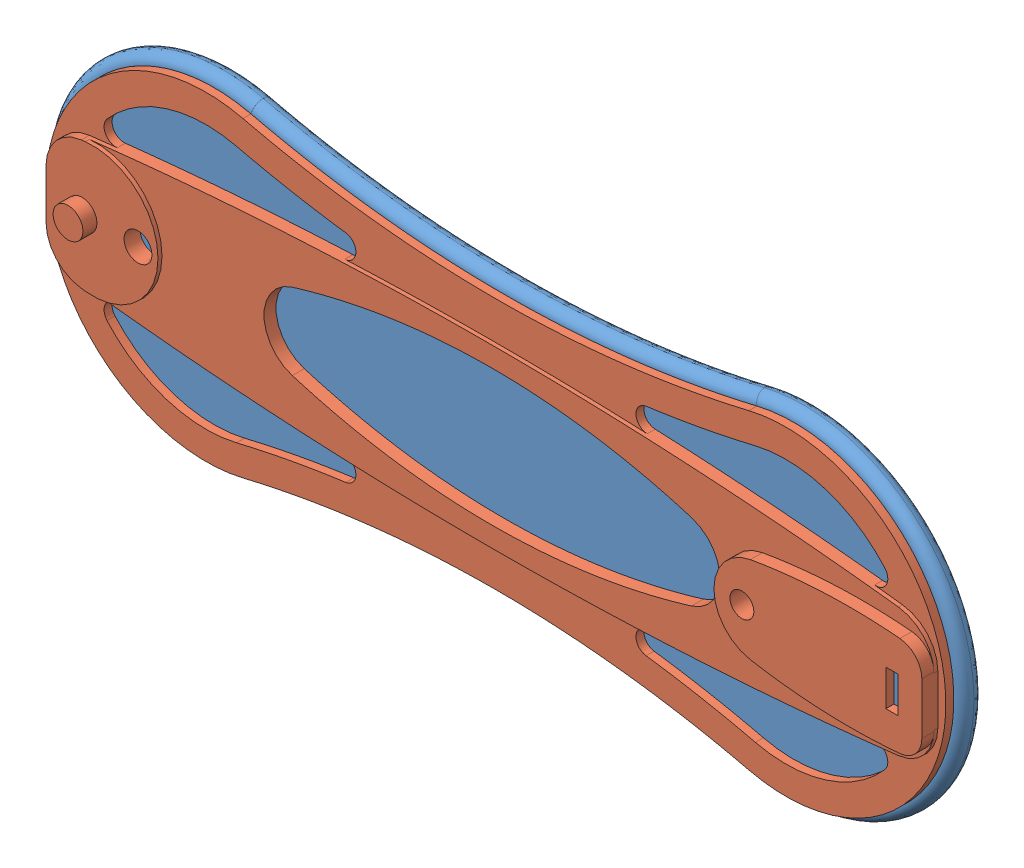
SolidWorks assembly GSangle2.SLDASM, configuration Default (file format 3800). Lengths in mm.
Overall size (230 85 172.86).
2 component instances, 2 part files, 3 mates.
Components (placement in the parent):
- Gsangle21-1: Gsangle21.SLDPRT [Default] at origin size (230 85 5)
- Gsangle22-1: Gsangle22.SLDPRT [Default] at (0 0 5) size (225 80 7.5)
Mates (geometry in assembly coordinates):
- Coïncidente1: coincident anti-aligned: plane of Gsangle21-1 through (36.25 152.4706 5) normal (0 0 1); plane of Gsangle22-1 through (36.25 152.4706 5) normal (0 0 -1)
- Coïncidente2: coincident aligned: unknown of Gsangle22-1
- Coïncidente3: coincident = 27.6931 mm aligned: unknown of Gsangle22-1
